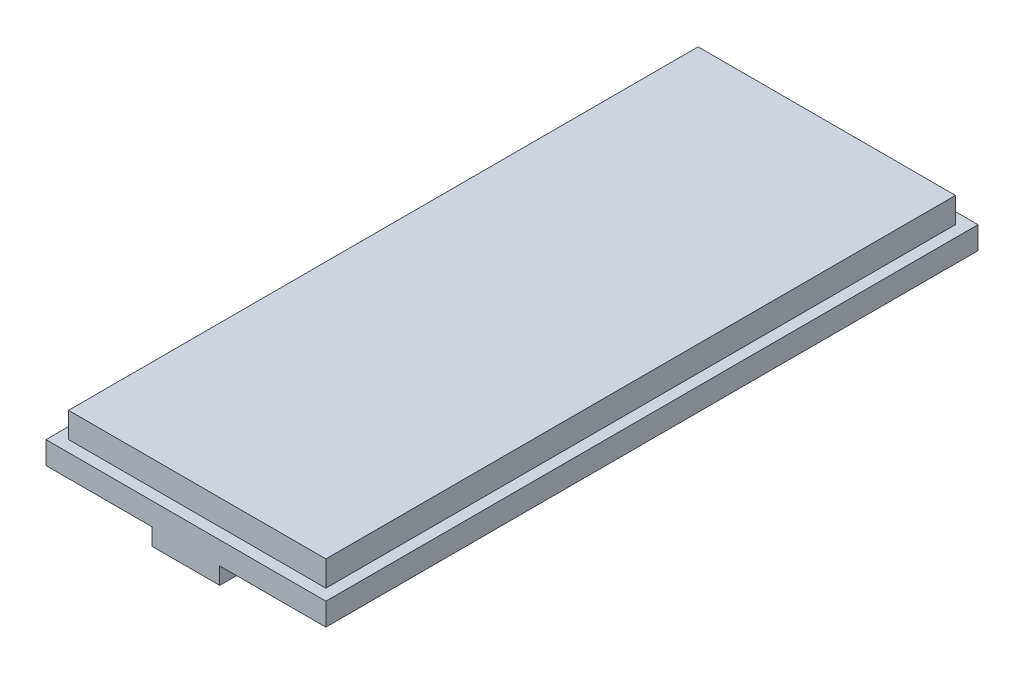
from build123d import *

# Parameters (mm, degrees)
ESQUISSE1_W      = 457
ESQUISSE1_H      = 45
EXTRUSION1_DEPTH = 1118
ESQUISSE3_W      = 497
ESQUISSE3_H      = 1158
EXTRUSION3_DEPTH = 40
ESQUISSE4_W      = 120
ESQUISSE4_H      = 1158
EXTRUSION4_DEPTH = 30


with BuildPart() as part:
    # Esquisse1 → Extrusion1 (new body)
    with BuildSketch(Plane.XY):
        with Locations((228.5, 22.5)):
            Rectangle(ESQUISSE1_W, ESQUISSE1_H)
    extrude(amount=EXTRUSION1_DEPTH)

    # Esquisse3 → Extrusion3 (add)
    with BuildSketch(Plane.XZ):
        with Locations((228.5, 559)):
            Rectangle(ESQUISSE3_W, ESQUISSE3_H)
    extrude(amount=EXTRUSION3_DEPTH)

    # Esquisse4 → Extrusion4 (add)
    with BuildSketch(Plane.XZ.offset(40)):
        with Locations((228.5, 559)):
            Rectangle(ESQUISSE4_W, ESQUISSE4_H)
    extrude(amount=EXTRUSION4_DEPTH)


solid = part.part
